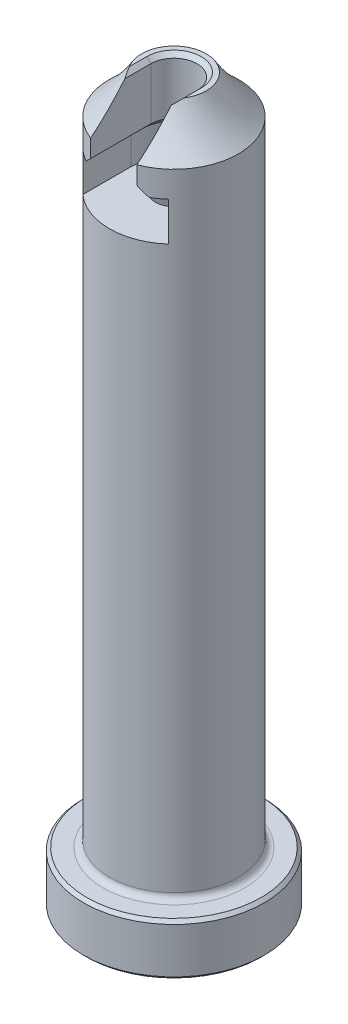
ISO-10303-21;
HEADER;
FILE_DESCRIPTION(('STEP AP214'),'2;1');
FILE_NAME('part.step','',(''),(''),'','','');
FILE_SCHEMA(('AUTOMOTIVE_DESIGN { 1 0 10303 214 1 1 1 1 }'));
ENDSEC;
DATA;
#1=APPLICATION_CONTEXT('core data for automotive mechanical design processes');
#2=APPLICATION_PROTOCOL_DEFINITION('international standard','automotive_design',2000,#1);
#3=PRODUCT_CONTEXT('',#1,'mechanical');
#4=PRODUCT('Part','Part','',(#3));
#5=PRODUCT_RELATED_PRODUCT_CATEGORY('part','',(#4));
#6=PRODUCT_DEFINITION_FORMATION('','',#4);
#7=PRODUCT_DEFINITION_CONTEXT('part definition',#1,'design');
#8=PRODUCT_DEFINITION('design','',#6,#7);
#9=PRODUCT_DEFINITION_SHAPE('','',#8);
#10=(LENGTH_UNIT() NAMED_UNIT(*) SI_UNIT(.MILLI.,.METRE.));
#11=(NAMED_UNIT(*) PLANE_ANGLE_UNIT() SI_UNIT($,.RADIAN.));
#12=(NAMED_UNIT(*) SI_UNIT($,.STERADIAN.) SOLID_ANGLE_UNIT());
#13=UNCERTAINTY_MEASURE_WITH_UNIT(LENGTH_MEASURE(1.E-05),#10,'distance_accuracy_value','');
#14=(GEOMETRIC_REPRESENTATION_CONTEXT(3) GLOBAL_UNCERTAINTY_ASSIGNED_CONTEXT((#13)) GLOBAL_UNIT_ASSIGNED_CONTEXT((#10,
#11,#12)) REPRESENTATION_CONTEXT('',''));
#15=CARTESIAN_POINT('',(0.,0.,0.));
#16=DIRECTION('',(0.,0.,1.));
#17=DIRECTION('',(1.,0.,0.));
#18=AXIS2_PLACEMENT_3D('',#15,#16,#17);
#19=CARTESIAN_POINT('',(0.,260.104415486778,0.));
#20=DIRECTION('',(0.,1.,0.));
#21=DIRECTION('',(0.,0.,1.));
#22=AXIS2_PLACEMENT_3D('',#19,#20,#21);
#23=CYLINDRICAL_SURFACE('',#22,7.93749999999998);
#24=CARTESIAN_POINT('',(0.,7.11200000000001,0.));
#25=DIRECTION('',(0.,1.,0.));
#26=DIRECTION('',(0.,0.,1.));
#27=AXIS2_PLACEMENT_3D('',#24,#25,#26);
#28=CIRCLE('',#27,7.93749999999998);
#29=CARTESIAN_POINT('',(0.,7.11200000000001,7.93749999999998));
#30=VERTEX_POINT('',#29);
#31=EDGE_CURVE('E43',#30,#30,#28,.T.);
#32=ORIENTED_EDGE('',*,*,#31,.T.);
#33=EDGE_LOOP('',(#32));
#34=FACE_BOUND('',#33,.T.);
#35=DIRECTION('',(0.,1.,0.));
#36=VECTOR('',#35,1.);
#37=CARTESIAN_POINT('',(2.8448,-0.001000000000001,7.41019697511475));
#38=LINE('',#37,#36);
#39=CARTESIAN_POINT('',(2.8448,81.9912,7.41019697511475));
#40=VERTEX_POINT('',#39);
#41=CARTESIAN_POINT('',(2.84479999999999,84.1756,7.41019697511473));
#42=VERTEX_POINT('',#41);
#43=EDGE_CURVE('E149',#40,#42,#38,.T.);
#44=ORIENTED_EDGE('',*,*,#43,.F.);
#45=CARTESIAN_POINT('',(0.,84.836,0.));
#46=DIRECTION('',(0.707106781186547,0.707106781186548,0.));
#47=DIRECTION('',(-0.707106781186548,0.707106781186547,0.));
#48=AXIS2_PLACEMENT_3D('',#45,#46,#47);
#49=ELLIPSE('',#48,11.2253201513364,7.93749999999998);
#50=CARTESIAN_POINT('',(3.86080000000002,80.9752,6.9352815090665));
#51=VERTEX_POINT('',#50);
#52=EDGE_CURVE('E171',#40,#51,#49,.T.);
#53=ORIENTED_EDGE('',*,*,#52,.T.);
#54=CARTESIAN_POINT('',(0.,80.9752,0.));
#55=DIRECTION('',(0.,1.,0.));
#56=DIRECTION('',(0.,0.,1.));
#57=AXIS2_PLACEMENT_3D('',#54,#55,#56);
#58=CIRCLE('',#57,7.93749999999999);
#59=CARTESIAN_POINT('',(5.2832,80.9752,5.92382511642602));
#60=VERTEX_POINT('',#59);
#61=EDGE_CURVE('E369',#51,#60,#58,.T.);
#62=ORIENTED_EDGE('',*,*,#61,.T.);
#63=DIRECTION('',(0.,-1.,0.));
#64=VECTOR('',#63,1.);
#65=CARTESIAN_POINT('',(5.2832,97.8996118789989,5.92382511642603));
#66=LINE('',#65,#64);
#67=CARTESIAN_POINT('',(5.2832,76.2,5.92382511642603));
#68=VERTEX_POINT('',#67);
#69=EDGE_CURVE('E393',#60,#68,#66,.T.);
#70=ORIENTED_EDGE('',*,*,#69,.T.);
#71=CARTESIAN_POINT('',(0.,76.2,0.));
#72=DIRECTION('',(0.,1.,0.));
#73=DIRECTION('',(0.,0.,1.));
#74=AXIS2_PLACEMENT_3D('',#71,#72,#73);
#75=CIRCLE('',#74,7.93749999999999);
#76=CARTESIAN_POINT('',(-5.2832,76.2,5.92382511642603));
#77=VERTEX_POINT('',#76);
#78=EDGE_CURVE('E392',#77,#68,#75,.T.);
#79=ORIENTED_EDGE('',*,*,#78,.F.);
#80=DIRECTION('',(0.,-1.,0.));
#81=VECTOR('',#80,1.);
#82=CARTESIAN_POINT('',(-5.2832,97.8996118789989,5.92382511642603));
#83=LINE('',#82,#81);
#84=CARTESIAN_POINT('',(-5.2832,80.9752,5.92382511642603));
#85=VERTEX_POINT('',#84);
#86=EDGE_CURVE('E390',#85,#77,#83,.T.);
#87=ORIENTED_EDGE('',*,*,#86,.F.);
#88=CARTESIAN_POINT('',(-3.86080000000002,80.9752,6.9352815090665));
#89=VERTEX_POINT('',#88);
#90=EDGE_CURVE('E374',#85,#89,#58,.T.);
#91=ORIENTED_EDGE('',*,*,#90,.T.);
#92=CARTESIAN_POINT('',(0.,84.836,0.));
#93=DIRECTION('',(-0.707106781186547,0.707106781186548,0.));
#94=DIRECTION('',(0.707106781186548,0.707106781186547,0.));
#95=AXIS2_PLACEMENT_3D('',#92,#93,#94);
#96=ELLIPSE('',#95,11.2253201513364,7.93749999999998);
#97=CARTESIAN_POINT('',(-2.8448,81.9912,7.41019697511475));
#98=VERTEX_POINT('',#97);
#99=EDGE_CURVE('E160',#89,#98,#96,.T.);
#100=ORIENTED_EDGE('',*,*,#99,.T.);
#101=DIRECTION('',(0.,1.,0.));
#102=VECTOR('',#101,1.);
#103=CARTESIAN_POINT('',(-2.8448,-0.001000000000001,7.41019697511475));
#104=LINE('',#103,#102);
#105=CARTESIAN_POINT('',(-2.8448,84.1756,7.41019697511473));
#106=VERTEX_POINT('',#105);
#107=EDGE_CURVE('E144',#98,#106,#104,.T.);
#108=ORIENTED_EDGE('',*,*,#107,.T.);
#109=CARTESIAN_POINT('',(0.,84.1756,0.));
#110=DIRECTION('',(0.,1.,0.));
#111=DIRECTION('',(0.,0.,1.));
#112=AXIS2_PLACEMENT_3D('',#109,#110,#111);
#113=CIRCLE('',#112,7.93749999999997);
#114=EDGE_CURVE('E138',#42,#106,#113,.T.);
#115=ORIENTED_EDGE('',*,*,#114,.F.);
#116=EDGE_LOOP('',(#44,#53,#62,#70,#79,#87,#91,#100,#108,#115));
#117=FACE_BOUND('',#116,.T.);
#118=ADVANCED_FACE('F35',(#34,#117),#23,.T.);
#119=CARTESIAN_POINT('',(0.,0.,0.));
#120=DIRECTION('',(0.,-1.,0.));
#121=DIRECTION('',(0.,0.,-1.));
#122=AXIS2_PLACEMENT_3D('',#119,#120,#121);
#123=PLANE('',#122);
#124=CARTESIAN_POINT('',(0.,0.,0.));
#125=DIRECTION('',(0.,-1.,0.));
#126=DIRECTION('',(0.,0.,-1.));
#127=AXIS2_PLACEMENT_3D('',#124,#125,#126);
#128=CIRCLE('',#127,3.048);
#129=CARTESIAN_POINT('',(0.,0.,-3.048));
#130=VERTEX_POINT('',#129);
#131=EDGE_CURVE('E206',#130,#130,#128,.F.);
#132=ORIENTED_EDGE('',*,*,#131,.T.);
#133=EDGE_LOOP('',(#132));
#134=FACE_BOUND('',#133,.T.);
#135=CARTESIAN_POINT('',(0.,0.,0.));
#136=DIRECTION('',(0.,-1.,0.));
#137=DIRECTION('',(0.,0.,-1.));
#138=AXIS2_PLACEMENT_3D('',#135,#136,#137);
#139=CIRCLE('',#138,10.7315);
#140=CARTESIAN_POINT('',(0.,0.,-10.7315));
#141=VERTEX_POINT('',#140);
#142=EDGE_CURVE('E197',#141,#141,#139,.T.);
#143=ORIENTED_EDGE('',*,*,#142,.T.);
#144=EDGE_LOOP('',(#143));
#145=FACE_BOUND('',#144,.T.);
#146=ADVANCED_FACE('F271',(#134,#145),#123,.T.);
#147=CARTESIAN_POINT('',(0.,260.104415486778,0.));
#148=DIRECTION('',(0.,1.,0.));
#149=DIRECTION('',(0.,0.,1.));
#150=AXIS2_PLACEMENT_3D('',#147,#148,#149);
#151=CYLINDRICAL_SURFACE('',#150,11.1125);
#152=CARTESIAN_POINT('',(0.,0.38100000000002,0.));
#153=DIRECTION('',(0.,-1.,0.));
#154=DIRECTION('',(0.,0.,-1.));
#155=AXIS2_PLACEMENT_3D('',#152,#153,#154);
#156=CIRCLE('',#155,11.1125);
#157=CARTESIAN_POINT('',(0.,0.38100000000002,-11.1125));
#158=VERTEX_POINT('',#157);
#159=EDGE_CURVE('E194',#158,#158,#156,.F.);
#160=ORIENTED_EDGE('',*,*,#159,.T.);
#161=EDGE_LOOP('',(#160));
#162=FACE_BOUND('',#161,.T.);
#163=CARTESIAN_POINT('',(0.,5.96899999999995,0.));
#164=DIRECTION('',(0.,1.,0.));
#165=DIRECTION('',(0.,0.,1.));
#166=AXIS2_PLACEMENT_3D('',#163,#164,#165);
#167=CIRCLE('',#166,11.1125);
#168=CARTESIAN_POINT('',(0.,5.96899999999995,11.1125));
#169=VERTEX_POINT('',#168);
#170=EDGE_CURVE('E183',#169,#169,#167,.F.);
#171=ORIENTED_EDGE('',*,*,#170,.T.);
#172=EDGE_LOOP('',(#171));
#173=FACE_BOUND('',#172,.T.);
#174=ADVANCED_FACE('F274',(#162,#173),#151,.T.);
#175=CARTESIAN_POINT('',(-11.1125,6.34999999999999,0.));
#176=DIRECTION('',(0.,1.,0.));
#177=DIRECTION('',(0.,0.,1.));
#178=AXIS2_PLACEMENT_3D('',#175,#176,#177);
#179=PLANE('',#178);
#180=CARTESIAN_POINT('',(0.,6.34999999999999,0.));
#181=DIRECTION('',(0.,1.,0.));
#182=DIRECTION('',(0.,0.,1.));
#183=AXIS2_PLACEMENT_3D('',#180,#181,#182);
#184=CIRCLE('',#183,8.69949999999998);
#185=CARTESIAN_POINT('',(0.,6.34999999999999,8.69949999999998));
#186=VERTEX_POINT('',#185);
#187=EDGE_CURVE('E12',#186,#186,#184,.F.);
#188=ORIENTED_EDGE('',*,*,#187,.T.);
#189=EDGE_LOOP('',(#188));
#190=FACE_BOUND('',#189,.T.);
#191=CARTESIAN_POINT('',(0.,6.34999999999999,0.));
#192=DIRECTION('',(0.,1.,0.));
#193=DIRECTION('',(0.,0.,1.));
#194=AXIS2_PLACEMENT_3D('',#191,#192,#193);
#195=CIRCLE('',#194,10.7314999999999);
#196=CARTESIAN_POINT('',(0.,6.34999999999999,10.7314999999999));
#197=VERTEX_POINT('',#196);
#198=EDGE_CURVE('E200',#197,#197,#195,.T.);
#199=ORIENTED_EDGE('',*,*,#198,.T.);
#200=EDGE_LOOP('',(#199));
#201=FACE_BOUND('',#200,.T.);
#202=ADVANCED_FACE('F278',(#190,#201),#179,.T.);
#203=CARTESIAN_POINT('',(0.,98.6404351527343,0.));
#204=DIRECTION('',(0.,1.,0.));
#205=DIRECTION('',(0.,0.,1.));
#206=AXIS2_PLACEMENT_3D('',#203,#204,#205);
#207=TOROIDAL_SURFACE('',#206,20.3339125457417,19.05);
#208=CARTESIAN_POINT('',(0.,88.9,0.));
#209=DIRECTION('',(0.,1.,0.));
#210=DIRECTION('',(0.,0.,1.));
#211=AXIS2_PLACEMENT_3D('',#208,#209,#210);
#212=CIRCLE('',#211,3.96239999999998);
#213=CARTESIAN_POINT('',(3.35279999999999,88.9,2.11171634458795));
#214=VERTEX_POINT('',#213);
#215=CARTESIAN_POINT('',(-3.35279999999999,88.9,2.11171634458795));
#216=VERTEX_POINT('',#215);
#217=EDGE_CURVE('E158',#214,#216,#212,.T.);
#218=ORIENTED_EDGE('',*,*,#217,.F.);
#219=CARTESIAN_POINT('',(3.35279999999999,88.9,2.11171634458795));
#220=CARTESIAN_POINT('',(3.31726358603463,88.8644635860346,2.20781187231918));
#221=CARTESIAN_POINT('',(3.27974791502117,88.8269479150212,2.30241191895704));
#222=CARTESIAN_POINT('',(3.20125496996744,88.7484549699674,2.48838390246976));
#223=CARTESIAN_POINT('',(3.16028645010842,88.7074864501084,2.57976321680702));
#224=CARTESIAN_POINT('',(3.07522099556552,88.6224209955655,2.75949772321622));
#225=CARTESIAN_POINT('',(3.03112519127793,88.5783251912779,2.84785399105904));
#226=CARTESIAN_POINT('',(2.94003217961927,88.4872321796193,3.02186512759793));
#227=CARTESIAN_POINT('',(2.89302807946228,88.4402280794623,3.10751279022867));
#228=CARTESIAN_POINT('',(2.84480000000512,88.3920000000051,3.19173245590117));
#229=B_SPLINE_CURVE_WITH_KNOTS('',3,(#219,#220,#221,#222,#223,#224,#225,#226,#227,#228),
.UNSPECIFIED.,.F.,.F.,(4,2,2,2,4),(0.,0.325244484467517,0.649687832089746,0.974014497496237,
1.29914168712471),.UNSPECIFIED.);
#230=CARTESIAN_POINT('',(2.8448,88.3920000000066,3.19173245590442));
#231=VERTEX_POINT('',#230);
#232=EDGE_CURVE('E140',#214,#231,#229,.T.);
#233=ORIENTED_EDGE('',*,*,#232,.T.);
#234=CARTESIAN_POINT('',(2.8448,83.1560143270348,-8.78831553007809));
#235=CARTESIAN_POINT('',(2.8448,83.355272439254,-8.49600042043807));
#236=CARTESIAN_POINT('',(2.8448,83.5616634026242,-8.20858987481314));
#237=CARTESIAN_POINT('',(2.8448,83.9876336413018,-7.64385696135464));
#238=CARTESIAN_POINT('',(2.8448,84.2072085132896,-7.36653127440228));
#239=CARTESIAN_POINT('',(2.8448,84.6573514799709,-6.82356216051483));
#240=CARTESIAN_POINT('',(2.8448,84.8878518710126,-6.55786248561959));
#241=CARTESIAN_POINT('',(2.8448,85.3598326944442,-6.03638656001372));
#242=CARTESIAN_POINT('',(2.8448,85.6013138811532,-5.78061099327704));
#243=CARTESIAN_POINT('',(2.8448,86.0838740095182,-5.28878249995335));
#244=CARTESIAN_POINT('',(2.8448,86.3245679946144,-5.05235062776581));
#245=CARTESIAN_POINT('',(2.8448,86.8134261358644,-4.5873864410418));
#246=CARTESIAN_POINT('',(2.8448,87.0615899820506,-4.35885379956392));
#247=CARTESIAN_POINT('',(2.8448,87.4381903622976,-4.02071405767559));
#248=CARTESIAN_POINT('',(2.8448,87.5645075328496,-3.9087279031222));
#249=CARTESIAN_POINT('',(2.8448,87.8182668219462,-3.68603677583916));
#250=CARTESIAN_POINT('',(2.8448,87.9457089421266,-3.57533180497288));
#251=CARTESIAN_POINT('',(2.8448,88.2013659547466,-3.35481593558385));
#252=CARTESIAN_POINT('',(2.8448,88.3295808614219,-3.24500505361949));
#253=CARTESIAN_POINT('',(2.8448,88.5863275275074,-3.02575528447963));
#254=CARTESIAN_POINT('',(2.8448,88.7148592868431,-2.91631639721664));
#255=CARTESIAN_POINT('',(2.8448,88.9369157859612,-2.7267130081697));
#256=CARTESIAN_POINT('',(2.8448,89.0305115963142,-2.64663193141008));
#257=CARTESIAN_POINT('',(2.8448,89.21720722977,-2.48590167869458));
#258=CARTESIAN_POINT('',(2.8448,89.3103070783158,-2.40525253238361));
#259=CARTESIAN_POINT('',(2.8448,89.4964459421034,-2.24212615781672));
#260=CARTESIAN_POINT('',(2.8448,89.5894761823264,-2.15963887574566));
#261=CARTESIAN_POINT('',(2.8448,89.773923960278,-1.99291912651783));
#262=CARTESIAN_POINT('',(2.8448,89.8653419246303,-1.90868713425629));
#263=CARTESIAN_POINT('',(2.8448,90.0466270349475,-1.73659069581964));
#264=CARTESIAN_POINT('',(2.8448,90.1364662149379,-1.64869656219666));
#265=CARTESIAN_POINT('',(2.8448,90.3121327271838,-1.46867458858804));
#266=CARTESIAN_POINT('',(2.8448,90.3979540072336,-1.37654075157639));
#267=CARTESIAN_POINT('',(2.8448,90.5620338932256,-1.18717517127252));
#268=CARTESIAN_POINT('',(2.8448,90.6403553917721,-1.08999878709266));
#269=CARTESIAN_POINT('',(2.8448,90.7855567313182,-0.8875813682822));
#270=CARTESIAN_POINT('',(2.8448,90.8524756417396,-0.782369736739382));
#271=CARTESIAN_POINT('',(2.8448,90.9517632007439,-0.590527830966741));
#272=CARTESIAN_POINT('',(2.8448,90.9885900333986,-0.506277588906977));
#273=CARTESIAN_POINT('',(2.8448,91.0465192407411,-0.332623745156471));
#274=CARTESIAN_POINT('',(2.8448,91.0676886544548,-0.243243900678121));
#275=CARTESIAN_POINT('',(2.8448,91.0878649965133,-0.0804347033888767));
#276=CARTESIAN_POINT('',(2.8448,91.0905065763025,-0.00746274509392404));
#277=CARTESIAN_POINT('',(2.8448,91.0828075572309,0.137839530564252));
#278=CARTESIAN_POINT('',(2.8448,91.0724535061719,0.210169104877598));
#279=CARTESIAN_POINT('',(2.8448,91.0358589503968,0.371686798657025));
#280=CARTESIAN_POINT('',(2.8448,91.0060323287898,0.460040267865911));
#281=CARTESIAN_POINT('',(2.8448,90.9329198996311,0.630954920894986));
#282=CARTESIAN_POINT('',(2.8448,90.8895970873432,0.713499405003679));
#283=CARTESIAN_POINT('',(2.8448,90.7764442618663,0.902553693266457));
#284=CARTESIAN_POINT('',(2.8448,90.7027299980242,1.0066807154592));
#285=CARTESIAN_POINT('',(2.8448,90.5456917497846,1.20752491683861));
#286=CARTESIAN_POINT('',(2.8448,90.4623435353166,1.3042223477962));
#287=CARTESIAN_POINT('',(2.8448,90.2892356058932,1.49316081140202));
#288=CARTESIAN_POINT('',(2.8448,90.1994271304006,1.58535662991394));
#289=CARTESIAN_POINT('',(2.8448,90.0621225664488,1.72086847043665));
#290=CARTESIAN_POINT('',(2.8448,90.0159501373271,1.76555013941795));
#291=CARTESIAN_POINT('',(2.8448,89.9228977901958,1.85416864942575));
#292=CARTESIAN_POINT('',(2.8448,89.8760179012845,1.89810552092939));
#293=CARTESIAN_POINT('',(2.8448,89.7198698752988,2.04261791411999));
#294=CARTESIAN_POINT('',(2.8448,89.6094120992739,2.14190448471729));
#295=CARTESIAN_POINT('',(2.8448,89.3868778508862,2.33865082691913));
#296=CARTESIAN_POINT('',(2.8448,89.2748012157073,2.43611041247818));
#297=CARTESIAN_POINT('',(2.8448,89.0498339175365,2.63014438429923));
#298=CARTESIAN_POINT('',(2.8448,88.9369430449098,2.72671852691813));
#299=CARTESIAN_POINT('',(2.8448,88.7109503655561,2.91962004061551));
#300=CARTESIAN_POINT('',(2.8448,88.5978485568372,3.01594740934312));
#301=CARTESIAN_POINT('',(2.8448,88.25870365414,3.30548163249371));
#302=CARTESIAN_POINT('',(2.8448,88.032999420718,3.49908979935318));
#303=CARTESIAN_POINT('',(2.8448,87.5848525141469,3.89000153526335));
#304=CARTESIAN_POINT('',(2.8448,87.3624093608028,4.08730455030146));
#305=CARTESIAN_POINT('',(2.8448,86.9240078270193,4.48559716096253));
#306=CARTESIAN_POINT('',(2.8448,86.7080122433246,4.68654564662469));
#307=CARTESIAN_POINT('',(2.8448,86.2818436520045,5.09455375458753));
#308=CARTESIAN_POINT('',(2.8448,86.0716708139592,5.30161355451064));
#309=CARTESIAN_POINT('',(2.8448,85.6580630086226,5.7224099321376));
#310=CARTESIAN_POINT('',(2.8448,85.454628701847,5.93614716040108));
#311=CARTESIAN_POINT('',(2.8448,85.0553202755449,6.3705680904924));
#312=CARTESIAN_POINT('',(2.8448,84.85944591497,6.59125157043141));
#313=CARTESIAN_POINT('',(2.8448,84.4723523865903,7.04389017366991));
#314=CARTESIAN_POINT('',(2.8448,84.2812894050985,7.27597906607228));
#315=CARTESIAN_POINT('',(2.8448,83.9084048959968,7.7474434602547));
#316=CARTESIAN_POINT('',(2.8448,83.7265827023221,7.98681843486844));
#317=CARTESIAN_POINT('',(2.8448,83.3727747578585,8.47271871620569));
#318=CARTESIAN_POINT('',(2.8448,83.2007883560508,8.71924354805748));
#319=CARTESIAN_POINT('',(2.8448,82.8671485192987,9.21927431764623));
#320=CARTESIAN_POINT('',(2.8448,82.7054981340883,9.47278228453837));
#321=CARTESIAN_POINT('',(2.8448,82.2356301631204,10.2453180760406));
#322=CARTESIAN_POINT('',(2.8448,81.9438607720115,10.7744906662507));
#323=CARTESIAN_POINT('',(2.8448,81.4078504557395,11.8563942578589));
#324=CARTESIAN_POINT('',(2.8448,81.1636056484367,12.4091233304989));
#325=CARTESIAN_POINT('',(2.8448,80.8424781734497,13.2338192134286));
#326=CARTESIAN_POINT('',(2.8448,80.7458334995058,13.498226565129));
#327=CARTESIAN_POINT('',(2.8448,80.5637710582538,14.0308018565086));
#328=CARTESIAN_POINT('',(2.8448,80.4783495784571,14.2989685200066));
#329=CARTESIAN_POINT('',(2.8448,80.3193220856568,14.8373594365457));
#330=CARTESIAN_POINT('',(2.8448,80.2456605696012,15.107567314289));
#331=CARTESIAN_POINT('',(2.8448,80.1098169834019,15.6509514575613));
#332=CARTESIAN_POINT('',(2.8448,80.0476388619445,15.9241287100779));
#333=CARTESIAN_POINT('',(2.8448,79.9913093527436,16.1985125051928));
#334=B_SPLINE_CURVE_WITH_KNOTS('',3,(#234,#235,#236,#237,#238,#239,#240,#241,#242,#243,#244,
#245,#246,#247,#248,#249,#250,#251,#252,#253,#254,#255,#256,#257,#258,#259,#260,#261,#262,#263,
#264,#265,#266,#267,#268,#269,#270,#271,#272,#273,#274,#275,#276,#277,#278,#279,#280,#281,#282,
#283,#284,#285,#286,#287,#288,#289,#290,#291,#292,#293,#294,#295,#296,#297,#298,#299,#300,#301,
#302,#303,#304,#305,#306,#307,#308,#309,#310,#311,#312,#313,#314,#315,#316,#317,#318,#319,#320,
#321,#322,#323,#324,#325,#326,#327,#328,#329,#330,#331,#332,#333),.UNSPECIFIED.,.F.,.F.,(4,2,2,
2,2,2,2,2,2,2,2,2,2,2,2,2,2,2,2,2,2,2,2,2,2,2,2,2,2,2,2,2,2,2,2,2,2,2,2,2,2,2,2,2,2,2,2,2,2,4),
(0.,1.0611483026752,2.12194414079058,3.17685826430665,4.23184496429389,5.2438216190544,
6.25575633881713,6.76218061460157,7.2686056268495,7.77503999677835,8.28147424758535,
8.65101156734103,9.0205297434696,9.3935166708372,9.76640337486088,10.1433756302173,
10.5208985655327,10.8949116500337,11.2676162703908,11.5424056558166,11.8160115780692,
12.0339132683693,12.2520407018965,12.5301610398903,12.8090507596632,13.190749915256,
13.5734308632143,13.9593864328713,14.152139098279,14.3448838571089,14.7904058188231,
15.2359729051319,15.681659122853,16.1273495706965,17.0194311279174,17.9113799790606,
18.79632545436,19.6812966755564,20.5663543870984,21.4513838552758,22.3530105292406,
23.2545721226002,24.1560739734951,25.0578406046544,26.8682901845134,28.6785918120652,
29.5229385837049,30.3670053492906,31.2069624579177,32.0472078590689),.UNSPECIFIED.);
#335=EDGE_CURVE('E133',#231,#42,#334,.T.);
#336=ORIENTED_EDGE('',*,*,#335,.T.);
#337=ORIENTED_EDGE('',*,*,#114,.T.);
#338=CARTESIAN_POINT('',(-2.8448,79.9913093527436,16.1985125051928));
#339=CARTESIAN_POINT('',(-2.8448,80.0481273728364,15.9217692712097));
#340=CARTESIAN_POINT('',(-2.8448,80.1108819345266,15.6462826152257));
#341=CARTESIAN_POINT('',(-2.8448,80.2480950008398,15.0982487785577));
#342=CARTESIAN_POINT('',(-2.8448,80.3225531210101,14.8257015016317));
#343=CARTESIAN_POINT('',(-2.8448,80.5631333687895,14.0134252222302));
#344=CARTESIAN_POINT('',(-2.8448,80.7465340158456,13.478709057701));
#345=CARTESIAN_POINT('',(-2.8448,81.155960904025,12.4303067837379));
#346=CARTESIAN_POINT('',(-2.8448,81.3816774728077,11.9164989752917));
#347=CARTESIAN_POINT('',(-2.8448,81.8742672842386,10.9089681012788));
#348=CARTESIAN_POINT('',(-2.8448,82.141143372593,10.4152464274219));
#349=CARTESIAN_POINT('',(-2.8448,82.7172307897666,9.44382602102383));
#350=CARTESIAN_POINT('',(-2.8448,83.0269832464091,8.96644901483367));
#351=CARTESIAN_POINT('',(-2.8448,83.6824864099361,8.03709850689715));
#352=CARTESIAN_POINT('',(-2.8448,84.0282368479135,7.58512481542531));
#353=CARTESIAN_POINT('',(-2.8448,84.5702154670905,6.92753886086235));
#354=CARTESIAN_POINT('',(-2.8448,84.7545370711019,6.71198052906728));
#355=CARTESIAN_POINT('',(-2.8448,85.1305068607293,6.28735365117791));
#356=CARTESIAN_POINT('',(-2.8448,85.3221547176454,6.07828481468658));
#357=CARTESIAN_POINT('',(-2.8448,85.7120876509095,5.66651318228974));
#358=CARTESIAN_POINT('',(-2.8448,85.9103716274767,5.46380934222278));
#359=CARTESIAN_POINT('',(-2.8448,86.312857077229,5.0643843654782));
#360=CARTESIAN_POINT('',(-2.8448,86.5170584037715,4.86766308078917));
#361=CARTESIAN_POINT('',(-2.8448,86.8974898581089,4.5105711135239));
#362=CARTESIAN_POINT('',(-2.8448,87.0729814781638,4.34941068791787));
#363=CARTESIAN_POINT('',(-2.8448,87.4269141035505,4.0302872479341));
#364=CARTESIAN_POINT('',(-2.8448,87.6053557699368,3.87232496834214));
#365=CARTESIAN_POINT('',(-2.8448,87.9663077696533,3.55708106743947));
#366=CARTESIAN_POINT('',(-2.8448,88.1488412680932,3.39982608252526));
#367=CARTESIAN_POINT('',(-2.8448,88.5146876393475,3.08669206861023));
#368=CARTESIAN_POINT('',(-2.8448,88.6979992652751,2.93081157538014));
#369=CARTESIAN_POINT('',(-2.8448,88.9736277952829,2.69530172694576));
#370=CARTESIAN_POINT('',(-2.8448,89.0662193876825,2.61599477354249));
#371=CARTESIAN_POINT('',(-2.8448,89.2508716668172,2.45676616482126));
#372=CARTESIAN_POINT('',(-2.8448,89.3429323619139,2.37684451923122));
#373=CARTESIAN_POINT('',(-2.8448,89.5265578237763,2.21547608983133));
#374=CARTESIAN_POINT('',(-2.8448,89.6181175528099,2.13402355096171));
#375=CARTESIAN_POINT('',(-2.8448,89.7995940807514,1.96934702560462));
#376=CARTESIAN_POINT('',(-2.8448,89.8895113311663,1.88612353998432));
#377=CARTESIAN_POINT('',(-2.8448,90.064848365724,1.71880967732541));
#378=CARTESIAN_POINT('',(-2.8448,90.1503234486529,1.63477764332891));
#379=CARTESIAN_POINT('',(-2.8448,90.317541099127,1.46281455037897));
#380=CARTESIAN_POINT('',(-2.8448,90.3992788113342,1.37487869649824));
#381=CARTESIAN_POINT('',(-2.8448,90.5558648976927,1.19442321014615));
#382=CARTESIAN_POINT('',(-2.8448,90.6307694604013,1.10195287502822));
#383=CARTESIAN_POINT('',(-2.8448,90.7704894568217,0.90976253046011));
#384=CARTESIAN_POINT('',(-2.8448,90.8353357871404,0.810066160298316));
#385=CARTESIAN_POINT('',(-2.8448,90.9108971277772,0.670304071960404));
#386=CARTESIAN_POINT('',(-2.8448,90.9290990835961,0.634293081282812));
#387=CARTESIAN_POINT('',(-2.8448,90.9631634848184,0.561160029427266));
#388=CARTESIAN_POINT('',(-2.8448,90.9790245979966,0.524037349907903));
#389=CARTESIAN_POINT('',(-2.8448,91.0223975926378,0.411208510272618));
#390=CARTESIAN_POINT('',(-2.8448,91.0458164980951,0.333833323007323));
#391=CARTESIAN_POINT('',(-2.8448,91.0784791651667,0.174991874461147));
#392=CARTESIAN_POINT('',(-2.8448,91.087539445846,0.0934861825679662));
#393=CARTESIAN_POINT('',(-2.8448,91.0891185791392,-0.0697653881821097));
#394=CARTESIAN_POINT('',(-2.8448,91.0816234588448,-0.151511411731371));
#395=CARTESIAN_POINT('',(-2.8448,91.0503818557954,-0.318360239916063));
#396=CARTESIAN_POINT('',(-2.8448,91.0254036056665,-0.403221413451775));
#397=CARTESIAN_POINT('',(-2.8448,90.9622584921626,-0.567818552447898));
#398=CARTESIAN_POINT('',(-2.8448,90.924066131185,-0.647544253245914));
#399=CARTESIAN_POINT('',(-2.8448,90.8284975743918,-0.820223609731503));
#400=CARTESIAN_POINT('',(-2.8448,90.7687190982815,-0.911812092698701));
#401=CARTESIAN_POINT('',(-2.8448,90.6405613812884,-1.0888464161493));
#402=CARTESIAN_POINT('',(-2.8448,90.5721635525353,-1.17427833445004));
#403=CARTESIAN_POINT('',(-2.8448,90.4293797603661,-1.34118018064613));
#404=CARTESIAN_POINT('',(-2.8448,90.3549478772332,-1.42261030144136));
#405=CARTESIAN_POINT('',(-2.8448,90.2406828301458,-1.54213334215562));
#406=CARTESIAN_POINT('',(-2.8448,90.2021780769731,-1.58151839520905));
#407=CARTESIAN_POINT('',(-2.8448,90.1244397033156,-1.65956033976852));
#408=CARTESIAN_POINT('',(-2.8448,90.0852061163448,-1.69821726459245));
#409=CARTESIAN_POINT('',(-2.8448,89.9574937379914,-1.82214006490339));
#410=CARTESIAN_POINT('',(-2.8448,89.867848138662,-1.90620134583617));
#411=CARTESIAN_POINT('',(-2.8448,89.686720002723,-2.07232614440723));
#412=CARTESIAN_POINT('',(-2.8448,89.5952372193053,-2.15438939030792));
#413=CARTESIAN_POINT('',(-2.8448,89.4111098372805,-2.3172715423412));
#414=CARTESIAN_POINT('',(-2.8448,89.3184647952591,-2.39808994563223));
#415=CARTESIAN_POINT('',(-2.8448,89.1325380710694,-2.55899236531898));
#416=CARTESIAN_POINT('',(-2.8448,89.0392563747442,-2.63907636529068));
#417=CARTESIAN_POINT('',(-2.8448,88.7587780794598,-2.87907568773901));
#418=CARTESIAN_POINT('',(-2.8448,88.5711884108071,-3.0385301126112));
#419=CARTESIAN_POINT('',(-2.8448,88.1969696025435,-3.35847919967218));
#420=CARTESIAN_POINT('',(-2.8448,88.0103402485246,-3.51897360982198));
#421=CARTESIAN_POINT('',(-2.8448,87.6407214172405,-3.84115913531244));
#422=CARTESIAN_POINT('',(-2.8448,87.457714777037,-4.00283047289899));
#423=CARTESIAN_POINT('',(-2.8448,87.0947091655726,-4.32954739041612));
#424=CARTESIAN_POINT('',(-2.8448,86.9147103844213,-4.49459318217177));
#425=CARTESIAN_POINT('',(-2.8448,86.5585103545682,-4.82858112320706));
#426=CARTESIAN_POINT('',(-2.8448,86.3823074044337,-4.99752145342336));
#427=CARTESIAN_POINT('',(-2.8448,86.0341938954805,-5.33976684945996));
#428=CARTESIAN_POINT('',(-2.8448,85.8622832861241,-5.51307186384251));
#429=CARTESIAN_POINT('',(-2.8448,85.4625390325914,-5.9272049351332));
#430=CARTESIAN_POINT('',(-2.8448,85.2367233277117,-6.16999003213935));
#431=CARTESIAN_POINT('',(-2.8448,84.795007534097,-6.66441427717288));
#432=CARTESIAN_POINT('',(-2.8448,84.5791071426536,-6.91605315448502));
#433=CARTESIAN_POINT('',(-2.8448,84.154782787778,-7.4323675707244));
#434=CARTESIAN_POINT('',(-2.8448,83.9465339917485,-7.69718737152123));
#435=CARTESIAN_POINT('',(-2.8448,83.5420366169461,-8.23596071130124));
#436=CARTESIAN_POINT('',(-2.8448,83.3457917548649,-8.50991703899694));
#437=CARTESIAN_POINT('',(-2.8448,83.1560143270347,-8.78831553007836));
#438=B_SPLINE_CURVE_WITH_KNOTS('',3,(#338,#339,#340,#341,#342,#343,#344,#345,#346,#347,#348,
#349,#350,#351,#352,#353,#354,#355,#356,#357,#358,#359,#360,#361,#362,#363,#364,#365,#366,#367,
#368,#369,#370,#371,#372,#373,#374,#375,#376,#377,#378,#379,#380,#381,#382,#383,#384,#385,#386,
#387,#388,#389,#390,#391,#392,#393,#394,#395,#396,#397,#398,#399,#400,#401,#402,#403,#404,#405,
#406,#407,#408,#409,#410,#411,#412,#413,#414,#415,#416,#417,#418,#419,#420,#421,#422,#423,#424,
#425,#426,#427,#428,#429,#430,#431,#432,#433,#434,#435,#436,#437),.UNSPECIFIED.,.F.,.F.,(4,2,2,
2,2,2,2,2,2,2,2,2,2,2,2,2,2,2,2,2,2,2,2,2,2,2,2,2,2,2,2,2,2,2,2,2,2,2,2,2,2,2,2,2,2,2,2,2,2,4),
(0.,0.847409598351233,1.69479136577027,3.38847810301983,5.07022260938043,6.7520834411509,
8.45752613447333,10.1629560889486,11.0136754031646,11.8643565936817,12.7148974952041,
13.565417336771,14.2801653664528,14.9950757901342,15.7178563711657,16.4397408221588,
16.8054790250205,17.1712114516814,17.5388380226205,17.9063619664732,18.265882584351,
18.6258577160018,18.9825394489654,19.3381028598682,19.4590773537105,19.5801204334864,
19.8214954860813,20.0659307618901,20.3105724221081,20.5744545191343,20.8388486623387,
21.1661412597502,21.4941521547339,21.8249485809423,21.9901825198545,22.155408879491,
22.5240323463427,22.8927056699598,23.2615242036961,23.6303509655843,24.3689579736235,
25.1073922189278,25.8399322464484,26.5725183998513,27.3047690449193,28.0370110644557,
29.0314571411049,30.0258728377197,31.036218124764,32.0468746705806),.UNSPECIFIED.);
#439=CARTESIAN_POINT('',(-2.8448,88.3919999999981,3.19173245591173));
#440=VERTEX_POINT('',#439);
#441=EDGE_CURVE('E145',#106,#440,#438,.T.);
#442=ORIENTED_EDGE('',*,*,#441,.T.);
#443=CARTESIAN_POINT('',(-2.8448,88.392,3.1917324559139));
#444=CARTESIAN_POINT('',(-2.89302807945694,88.4402280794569,3.10751279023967));
#445=CARTESIAN_POINT('',(-2.94003217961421,88.4872321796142,3.02186512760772));
#446=CARTESIAN_POINT('',(-3.03112519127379,88.5783251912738,2.84785399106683));
#447=CARTESIAN_POINT('',(-3.07522099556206,88.622420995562,2.75949772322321));
#448=CARTESIAN_POINT('',(-3.16028645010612,88.7074864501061,2.5797632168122));
#449=CARTESIAN_POINT('',(-3.20125496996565,88.7484549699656,2.48838390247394));
#450=CARTESIAN_POINT('',(-3.27974791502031,88.8269479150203,2.30241191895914));
#451=CARTESIAN_POINT('',(-3.31726358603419,88.8644635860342,2.20781187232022));
#452=CARTESIAN_POINT('',(-3.35279999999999,88.9,2.11171634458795));
#453=B_SPLINE_CURVE_WITH_KNOTS('',3,(#443,#444,#445,#446,#447,#448,#449,#450,#451,#452),
.UNSPECIFIED.,.F.,.F.,(4,2,2,2,4),(0.,0.325127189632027,0.649453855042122,0.973897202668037,
1.2991416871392),.UNSPECIFIED.);
#454=EDGE_CURVE('E217',#440,#216,#453,.T.);
#455=ORIENTED_EDGE('',*,*,#454,.T.);
#456=EDGE_LOOP('',(#218,#233,#336,#337,#442,#455));
#457=FACE_BOUND('',#456,.T.);
#458=ADVANCED_FACE('F136',(#457),#207,.F.);
#459=CARTESIAN_POINT('',(-3.96239999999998,88.9,0.));
#460=DIRECTION('',(0.,1.,0.));
#461=DIRECTION('',(0.,0.,1.));
#462=AXIS2_PLACEMENT_3D('',#459,#460,#461);
#463=PLANE('',#462);
#464=CARTESIAN_POINT('',(0.,88.9,0.));
#465=DIRECTION('',(0.,1.,0.));
#466=DIRECTION('',(0.,0.,1.));
#467=AXIS2_PLACEMENT_3D('',#464,#465,#466);
#468=CIRCLE('',#467,3.35279999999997);
#469=CARTESIAN_POINT('',(-3.35279999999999,88.9,0.));
#470=VERTEX_POINT('',#469);
#471=CARTESIAN_POINT('',(3.35279999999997,88.9,0.));
#472=VERTEX_POINT('',#471);
#473=EDGE_CURVE('E213',#470,#472,#468,.F.);
#474=ORIENTED_EDGE('',*,*,#473,.T.);
#475=DIRECTION('',(0.,0.,1.));
#476=VECTOR('',#475,1.);
#477=CARTESIAN_POINT('',(3.35279999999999,88.9,2.75821078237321));
#478=LINE('',#477,#476);
#479=EDGE_CURVE('E215',#472,#214,#478,.T.);
#480=ORIENTED_EDGE('',*,*,#479,.T.);
#481=ORIENTED_EDGE('',*,*,#217,.T.);
#482=DIRECTION('',(0.,0.,-1.));
#483=VECTOR('',#482,1.);
#484=CARTESIAN_POINT('',(-3.35279999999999,88.9,0.));
#485=LINE('',#484,#483);
#486=EDGE_CURVE('E211',#216,#470,#485,.T.);
#487=ORIENTED_EDGE('',*,*,#486,.T.);
#488=EDGE_LOOP('',(#474,#480,#481,#487));
#489=FACE_BOUND('',#488,.T.);
#490=ADVANCED_FACE('F351',(#489),#463,.T.);
#491=CARTESIAN_POINT('',(0.,88.9,0.));
#492=DIRECTION('',(0.,-1.,0.));
#493=DIRECTION('',(0.,0.,-1.));
#494=AXIS2_PLACEMENT_3D('',#491,#492,#493);
#495=CYLINDRICAL_SURFACE('',#494,2.286);
#496=CARTESIAN_POINT('',(0.,0.761999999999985,0.));
#497=DIRECTION('',(0.,-1.,0.));
#498=DIRECTION('',(0.,0.,-1.));
#499=AXIS2_PLACEMENT_3D('',#496,#497,#498);
#500=CIRCLE('',#499,2.286);
#501=CARTESIAN_POINT('',(0.,0.761999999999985,-2.286));
#502=VERTEX_POINT('',#501);
#503=EDGE_CURVE('E203',#502,#502,#500,.T.);
#504=ORIENTED_EDGE('',*,*,#503,.T.);
#505=EDGE_LOOP('',(#504));
#506=FACE_BOUND('',#505,.T.);
#507=CARTESIAN_POINT('',(0.,76.2,0.));
#508=DIRECTION('',(0.,-1.,0.));
#509=DIRECTION('',(0.,0.,-1.));
#510=AXIS2_PLACEMENT_3D('',#507,#508,#509);
#511=CIRCLE('',#510,2.286);
#512=CARTESIAN_POINT('',(0.,76.2,-2.286));
#513=VERTEX_POINT('',#512);
#514=EDGE_CURVE('E163',#513,#513,#511,.F.);
#515=ORIENTED_EDGE('',*,*,#514,.T.);
#516=EDGE_LOOP('',(#515));
#517=FACE_BOUND('',#516,.T.);
#518=ADVANCED_FACE('F348',(#506,#517),#495,.F.);
#519=CARTESIAN_POINT('',(0.,76.2,0.));
#520=DIRECTION('',(0.,-1.,0.));
#521=DIRECTION('',(0.,0.,-1.));
#522=AXIS2_PLACEMENT_3D('',#519,#520,#521);
#523=PLANE('',#522);
#524=CARTESIAN_POINT('',(0.,76.2,0.));
#525=DIRECTION('',(0.,1.,0.));
#526=DIRECTION('',(0.,0.,1.));
#527=AXIS2_PLACEMENT_3D('',#524,#525,#526);
#528=CIRCLE('',#527,5.28319999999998);
#529=CARTESIAN_POINT('',(5.2832,76.2,0.));
#530=VERTEX_POINT('',#529);
#531=CARTESIAN_POINT('',(-5.2832,76.2,0.));
#532=VERTEX_POINT('',#531);
#533=EDGE_CURVE('E168',#530,#532,#528,.T.);
#534=ORIENTED_EDGE('',*,*,#533,.T.);
#535=DIRECTION('',(0.,0.,1.));
#536=VECTOR('',#535,1.);
#537=CARTESIAN_POINT('',(-5.2832,76.2,0.));
#538=LINE('',#537,#536);
#539=EDGE_CURVE('E382',#532,#77,#538,.T.);
#540=ORIENTED_EDGE('',*,*,#539,.T.);
#541=ORIENTED_EDGE('',*,*,#78,.T.);
#542=DIRECTION('',(0.,0.,-1.));
#543=VECTOR('',#542,1.);
#544=CARTESIAN_POINT('',(5.2832,76.2,0.));
#545=LINE('',#544,#543);
#546=EDGE_CURVE('E386',#68,#530,#545,.T.);
#547=ORIENTED_EDGE('',*,*,#546,.T.);
#548=EDGE_LOOP('',(#534,#540,#541,#547));
#549=FACE_BOUND('',#548,.T.);
#550=ORIENTED_EDGE('',*,*,#514,.F.);
#551=EDGE_LOOP('',(#550));
#552=FACE_BOUND('',#551,.T.);
#553=ADVANCED_FACE('F344',(#549,#552),#523,.F.);
#554=CARTESIAN_POINT('',(0.,234.452866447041,0.));
#555=DIRECTION('',(0.,1.,0.));
#556=DIRECTION('',(0.,0.,1.));
#557=AXIS2_PLACEMENT_3D('',#554,#555,#556);
#558=CYLINDRICAL_SURFACE('',#557,5.28319999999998);
#559=CARTESIAN_POINT('',(0.,80.9752,0.));
#560=DIRECTION('',(0.,1.,0.));
#561=DIRECTION('',(0.,0.,1.));
#562=AXIS2_PLACEMENT_3D('',#559,#560,#561);
#563=CIRCLE('',#562,5.28319999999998);
#564=CARTESIAN_POINT('',(5.2832,80.9752,0.));
#565=VERTEX_POINT('',#564);
#566=CARTESIAN_POINT('',(-5.2832,80.9752,0.));
#567=VERTEX_POINT('',#566);
#568=EDGE_CURVE('E378',#565,#567,#563,.T.);
#569=ORIENTED_EDGE('',*,*,#568,.T.);
#570=DIRECTION('',(0.,-1.,0.));
#571=VECTOR('',#570,1.);
#572=CARTESIAN_POINT('',(-5.2832,97.8996118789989,0.));
#573=LINE('',#572,#571);
#574=EDGE_CURVE('E387',#567,#532,#573,.T.);
#575=ORIENTED_EDGE('',*,*,#574,.T.);
#576=ORIENTED_EDGE('',*,*,#533,.F.);
#577=DIRECTION('',(0.,-1.,0.));
#578=VECTOR('',#577,1.);
#579=CARTESIAN_POINT('',(5.2832,97.8996118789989,0.));
#580=LINE('',#579,#578);
#581=EDGE_CURVE('E155',#565,#530,#580,.T.);
#582=ORIENTED_EDGE('',*,*,#581,.F.);
#583=EDGE_LOOP('',(#569,#575,#576,#582));
#584=FACE_BOUND('',#583,.T.);
#585=ADVANCED_FACE('F340',(#584),#558,.F.);
#586=CARTESIAN_POINT('',(-5.28319999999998,80.9752,0.));
#587=DIRECTION('',(0.,1.,0.));
#588=DIRECTION('',(0.,0.,1.));
#589=AXIS2_PLACEMENT_3D('',#586,#587,#588);
#590=PLANE('',#589);
#591=ORIENTED_EDGE('',*,*,#61,.F.);
#592=DIRECTION('',(0.,0.,-1.));
#593=VECTOR('',#592,1.);
#594=CARTESIAN_POINT('',(3.86080000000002,80.9752,0.));
#595=LINE('',#594,#593);
#596=CARTESIAN_POINT('',(3.8608,80.9752,0.));
#597=VERTEX_POINT('',#596);
#598=EDGE_CURVE('E177',#51,#597,#595,.T.);
#599=ORIENTED_EDGE('',*,*,#598,.T.);
#600=CARTESIAN_POINT('',(0.,80.9752,0.));
#601=DIRECTION('',(0.,1.,0.));
#602=DIRECTION('',(0.,0.,1.));
#603=AXIS2_PLACEMENT_3D('',#600,#601,#602);
#604=CIRCLE('',#603,3.8608);
#605=CARTESIAN_POINT('',(-3.8608,80.9752,0.));
#606=VERTEX_POINT('',#605);
#607=EDGE_CURVE('E173',#597,#606,#604,.T.);
#608=ORIENTED_EDGE('',*,*,#607,.T.);
#609=DIRECTION('',(0.,0.,1.));
#610=VECTOR('',#609,1.);
#611=CARTESIAN_POINT('',(-3.86080000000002,80.9752,0.));
#612=LINE('',#611,#610);
#613=EDGE_CURVE('E175',#606,#89,#612,.T.);
#614=ORIENTED_EDGE('',*,*,#613,.T.);
#615=ORIENTED_EDGE('',*,*,#90,.F.);
#616=DIRECTION('',(0.,0.,1.));
#617=VECTOR('',#616,1.);
#618=CARTESIAN_POINT('',(-5.2832,80.9752,0.));
#619=LINE('',#618,#617);
#620=EDGE_CURVE('E375',#567,#85,#619,.T.);
#621=ORIENTED_EDGE('',*,*,#620,.F.);
#622=ORIENTED_EDGE('',*,*,#568,.F.);
#623=DIRECTION('',(0.,0.,-1.));
#624=VECTOR('',#623,1.);
#625=CARTESIAN_POINT('',(5.2832,80.9752,0.));
#626=LINE('',#625,#624);
#627=EDGE_CURVE('E372',#60,#565,#626,.T.);
#628=ORIENTED_EDGE('',*,*,#627,.F.);
#629=EDGE_LOOP('',(#591,#599,#608,#614,#615,#621,#622,#628));
#630=FACE_BOUND('',#629,.T.);
#631=ADVANCED_FACE('F337',(#630),#590,.F.);
#632=CARTESIAN_POINT('',(0.,234.452866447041,0.));
#633=DIRECTION('',(0.,1.,0.));
#634=DIRECTION('',(0.,0.,1.));
#635=AXIS2_PLACEMENT_3D('',#632,#633,#634);
#636=CYLINDRICAL_SURFACE('',#635,2.84479999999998);
#637=DIRECTION('',(0.,1.,0.));
#638=VECTOR('',#637,1.);
#639=CARTESIAN_POINT('',(2.84479999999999,234.452866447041,0.));
#640=LINE('',#639,#638);
#641=CARTESIAN_POINT('',(2.84479999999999,81.9912,0.));
#642=VERTEX_POINT('',#641);
#643=CARTESIAN_POINT('',(2.84479999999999,88.392,0.));
#644=VERTEX_POINT('',#643);
#645=EDGE_CURVE('E298',#642,#644,#640,.T.);
#646=ORIENTED_EDGE('',*,*,#645,.T.);
#647=CARTESIAN_POINT('',(0.,88.392,0.));
#648=DIRECTION('',(0.,1.,0.));
#649=DIRECTION('',(0.,0.,1.));
#650=AXIS2_PLACEMENT_3D('',#647,#648,#649);
#651=CIRCLE('',#650,2.84479999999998);
#652=CARTESIAN_POINT('',(-2.84479999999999,88.392,0.));
#653=VERTEX_POINT('',#652);
#654=EDGE_CURVE('E50',#644,#653,#651,.T.);
#655=ORIENTED_EDGE('',*,*,#654,.T.);
#656=DIRECTION('',(0.,1.,0.));
#657=VECTOR('',#656,1.);
#658=CARTESIAN_POINT('',(-2.84479999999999,234.452866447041,0.));
#659=LINE('',#658,#657);
#660=CARTESIAN_POINT('',(-2.84479999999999,81.9912,0.));
#661=VERTEX_POINT('',#660);
#662=EDGE_CURVE('E191',#661,#653,#659,.T.);
#663=ORIENTED_EDGE('',*,*,#662,.F.);
#664=CARTESIAN_POINT('',(0.,81.9912,0.));
#665=DIRECTION('',(0.,1.,0.));
#666=DIRECTION('',(0.,0.,1.));
#667=AXIS2_PLACEMENT_3D('',#664,#665,#666);
#668=CIRCLE('',#667,2.84479999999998);
#669=EDGE_CURVE('E181',#661,#642,#668,.F.);
#670=ORIENTED_EDGE('',*,*,#669,.T.);
#671=EDGE_LOOP('',(#646,#655,#663,#670));
#672=FACE_BOUND('',#671,.T.);
#673=ADVANCED_FACE('F300',(#672),#636,.F.);
#674=CARTESIAN_POINT('',(-5.2832,97.8996118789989,0.));
#675=DIRECTION('',(1.,0.,0.));
#676=DIRECTION('',(0.,0.,-1.));
#677=AXIS2_PLACEMENT_3D('',#674,#675,#676);
#678=PLANE('',#677);
#679=ORIENTED_EDGE('',*,*,#620,.T.);
#680=ORIENTED_EDGE('',*,*,#86,.T.);
#681=ORIENTED_EDGE('',*,*,#539,.F.);
#682=ORIENTED_EDGE('',*,*,#574,.F.);
#683=EDGE_LOOP('',(#679,#680,#681,#682));
#684=FACE_BOUND('',#683,.T.);
#685=ADVANCED_FACE('F327',(#684),#678,.T.);
#686=CARTESIAN_POINT('',(5.2832,97.8996118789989,0.));
#687=DIRECTION('',(-1.,0.,0.));
#688=DIRECTION('',(0.,0.,1.));
#689=AXIS2_PLACEMENT_3D('',#686,#687,#688);
#690=PLANE('',#689);
#691=ORIENTED_EDGE('',*,*,#627,.T.);
#692=ORIENTED_EDGE('',*,*,#581,.T.);
#693=ORIENTED_EDGE('',*,*,#546,.F.);
#694=ORIENTED_EDGE('',*,*,#69,.F.);
#695=EDGE_LOOP('',(#691,#692,#693,#694));
#696=FACE_BOUND('',#695,.T.);
#697=ADVANCED_FACE('F322',(#696),#690,.T.);
#698=CARTESIAN_POINT('',(2.8448,-0.001000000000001,0.));
#699=DIRECTION('',(1.,0.,0.));
#700=DIRECTION('',(0.,0.,-1.));
#701=AXIS2_PLACEMENT_3D('',#698,#699,#700);
#702=PLANE('',#701);
#703=ORIENTED_EDGE('',*,*,#335,.F.);
#704=DIRECTION('',(0.,0.,-1.));
#705=VECTOR('',#704,1.);
#706=CARTESIAN_POINT('',(2.8448,88.392,0.));
#707=LINE('',#706,#705);
#708=EDGE_CURVE('E209',#231,#644,#707,.T.);
#709=ORIENTED_EDGE('',*,*,#708,.T.);
#710=ORIENTED_EDGE('',*,*,#645,.F.);
#711=DIRECTION('',(0.,0.,1.));
#712=VECTOR('',#711,1.);
#713=CARTESIAN_POINT('',(2.8448,81.9912,0.));
#714=LINE('',#713,#712);
#715=EDGE_CURVE('E153',#642,#40,#714,.T.);
#716=ORIENTED_EDGE('',*,*,#715,.T.);
#717=ORIENTED_EDGE('',*,*,#43,.T.);
#718=EDGE_LOOP('',(#703,#709,#710,#716,#717));
#719=FACE_BOUND('',#718,.T.);
#720=ADVANCED_FACE('F150',(#719),#702,.F.);
#721=CARTESIAN_POINT('',(-2.8448,-0.001000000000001,0.));
#722=DIRECTION('',(-1.,0.,0.));
#723=DIRECTION('',(0.,0.,1.));
#724=AXIS2_PLACEMENT_3D('',#721,#722,#723);
#725=PLANE('',#724);
#726=ORIENTED_EDGE('',*,*,#662,.T.);
#727=DIRECTION('',(0.,0.,1.));
#728=VECTOR('',#727,1.);
#729=CARTESIAN_POINT('',(-2.8448,88.392,2.75821078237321));
#730=LINE('',#729,#728);
#731=EDGE_CURVE('E57',#653,#440,#730,.T.);
#732=ORIENTED_EDGE('',*,*,#731,.T.);
#733=ORIENTED_EDGE('',*,*,#441,.F.);
#734=ORIENTED_EDGE('',*,*,#107,.F.);
#735=DIRECTION('',(0.,0.,-1.));
#736=VECTOR('',#735,1.);
#737=CARTESIAN_POINT('',(-2.8448,81.9912,0.));
#738=LINE('',#737,#736);
#739=EDGE_CURVE('E179',#98,#661,#738,.T.);
#740=ORIENTED_EDGE('',*,*,#739,.T.);
#741=EDGE_LOOP('',(#726,#732,#733,#734,#740));
#742=FACE_BOUND('',#741,.T.);
#743=ADVANCED_FACE('F263',(#742),#725,.F.);
#744=CARTESIAN_POINT('',(-2.8448,81.9912,0.));
#745=DIRECTION('',(-0.707106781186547,0.707106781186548,0.));
#746=DIRECTION('',(0.,0.,-1.));
#747=AXIS2_PLACEMENT_3D('',#744,#745,#746);
#748=PLANE('',#747);
#749=ORIENTED_EDGE('',*,*,#99,.F.);
#750=ORIENTED_EDGE('',*,*,#613,.F.);
#751=DIRECTION('',(-0.707106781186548,-0.707106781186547,0.));
#752=VECTOR('',#751,1.);
#753=CARTESIAN_POINT('',(-2.8448,81.9912,0.));
#754=LINE('',#753,#752);
#755=EDGE_CURVE('E187',#661,#606,#754,.T.);
#756=ORIENTED_EDGE('',*,*,#755,.F.);
#757=ORIENTED_EDGE('',*,*,#739,.F.);
#758=EDGE_LOOP('',(#749,#750,#756,#757));
#759=FACE_BOUND('',#758,.T.);
#760=ADVANCED_FACE('F259',(#759),#748,.F.);
#761=CARTESIAN_POINT('',(0.,80.9752,0.));
#762=DIRECTION('',(0.,-1.,0.));
#763=DIRECTION('',(0.,0.,-1.));
#764=AXIS2_PLACEMENT_3D('',#761,#762,#763);
#765=CONICAL_SURFACE('',#764,3.8608,0.78539816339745);
#766=ORIENTED_EDGE('',*,*,#755,.T.);
#767=ORIENTED_EDGE('',*,*,#607,.F.);
#768=DIRECTION('',(0.707106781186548,-0.707106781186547,0.));
#769=VECTOR('',#768,1.);
#770=CARTESIAN_POINT('',(2.84479999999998,81.9912,0.));
#771=LINE('',#770,#769);
#772=EDGE_CURVE('E184',#642,#597,#771,.T.);
#773=ORIENTED_EDGE('',*,*,#772,.F.);
#774=ORIENTED_EDGE('',*,*,#669,.F.);
#775=EDGE_LOOP('',(#766,#767,#773,#774));
#776=FACE_BOUND('',#775,.T.);
#777=ADVANCED_FACE('F262',(#776),#765,.F.);
#778=CARTESIAN_POINT('',(2.8448,81.9912,0.));
#779=DIRECTION('',(0.707106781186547,0.707106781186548,0.));
#780=DIRECTION('',(0.,0.,1.));
#781=AXIS2_PLACEMENT_3D('',#778,#779,#780);
#782=PLANE('',#781);
#783=ORIENTED_EDGE('',*,*,#772,.T.);
#784=ORIENTED_EDGE('',*,*,#598,.F.);
#785=ORIENTED_EDGE('',*,*,#52,.F.);
#786=ORIENTED_EDGE('',*,*,#715,.F.);
#787=EDGE_LOOP('',(#783,#784,#785,#786));
#788=FACE_BOUND('',#787,.T.);
#789=ADVANCED_FACE('F257',(#788),#782,.F.);
#790=CARTESIAN_POINT('',(0.,0.38100000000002,0.));
#791=DIRECTION('',(0.,1.,0.));
#792=DIRECTION('',(0.,0.,1.));
#793=AXIS2_PLACEMENT_3D('',#790,#791,#792);
#794=CONICAL_SURFACE('',#793,11.1125,0.785398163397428);
#795=ORIENTED_EDGE('',*,*,#142,.F.);
#796=EDGE_LOOP('',(#795));
#797=FACE_BOUND('',#796,.T.);
#798=ORIENTED_EDGE('',*,*,#159,.F.);
#799=EDGE_LOOP('',(#798));
#800=FACE_BOUND('',#799,.T.);
#801=ADVANCED_FACE('F253',(#797,#800),#794,.T.);
#802=CARTESIAN_POINT('',(0.,6.34999999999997,0.));
#803=DIRECTION('',(0.,-1.,0.));
#804=DIRECTION('',(0.,0.,-1.));
#805=AXIS2_PLACEMENT_3D('',#802,#803,#804);
#806=CONICAL_SURFACE('',#805,10.7314999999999,0.785398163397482);
#807=ORIENTED_EDGE('',*,*,#170,.F.);
#808=EDGE_LOOP('',(#807));
#809=FACE_BOUND('',#808,.T.);
#810=ORIENTED_EDGE('',*,*,#198,.F.);
#811=EDGE_LOOP('',(#810));
#812=FACE_BOUND('',#811,.T.);
#813=ADVANCED_FACE('F249',(#809,#812),#806,.T.);
#814=CARTESIAN_POINT('',(0.,0.761999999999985,0.));
#815=DIRECTION('',(0.,-1.,0.));
#816=DIRECTION('',(0.,0.,-1.));
#817=AXIS2_PLACEMENT_3D('',#814,#815,#816);
#818=CONICAL_SURFACE('',#817,2.286,0.785398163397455);
#819=ORIENTED_EDGE('',*,*,#131,.F.);
#820=EDGE_LOOP('',(#819));
#821=FACE_BOUND('',#820,.T.);
#822=ORIENTED_EDGE('',*,*,#503,.F.);
#823=EDGE_LOOP('',(#822));
#824=FACE_BOUND('',#823,.T.);
#825=ADVANCED_FACE('F238',(#821,#824),#818,.F.);
#826=CARTESIAN_POINT('',(-2.8448,88.392,0.));
#827=DIRECTION('',(0.707106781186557,0.707106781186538,0.));
#828=DIRECTION('',(0.,0.,-1.));
#829=AXIS2_PLACEMENT_3D('',#826,#827,#828);
#830=PLANE('',#829);
#831=ORIENTED_EDGE('',*,*,#454,.F.);
#832=ORIENTED_EDGE('',*,*,#731,.F.);
#833=DIRECTION('',(0.707106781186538,-0.707106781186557,0.));
#834=VECTOR('',#833,1.);
#835=CARTESIAN_POINT('',(-3.35279999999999,88.9,0.));
#836=LINE('',#835,#834);
#837=EDGE_CURVE('E188',#470,#653,#836,.T.);
#838=ORIENTED_EDGE('',*,*,#837,.F.);
#839=ORIENTED_EDGE('',*,*,#486,.F.);
#840=EDGE_LOOP('',(#831,#832,#838,#839));
#841=FACE_BOUND('',#840,.T.);
#842=ADVANCED_FACE('F233',(#841),#830,.T.);
#843=CARTESIAN_POINT('',(0.,88.392,0.));
#844=DIRECTION('',(0.,1.,0.));
#845=DIRECTION('',(0.,0.,1.));
#846=AXIS2_PLACEMENT_3D('',#843,#844,#845);
#847=CONICAL_SURFACE('',#846,2.84479999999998,0.785398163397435);
#848=ORIENTED_EDGE('',*,*,#837,.T.);
#849=ORIENTED_EDGE('',*,*,#654,.F.);
#850=DIRECTION('',(-0.707106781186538,-0.707106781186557,0.));
#851=VECTOR('',#850,1.);
#852=CARTESIAN_POINT('',(3.35279999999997,88.9,0.));
#853=LINE('',#852,#851);
#854=EDGE_CURVE('E293',#472,#644,#853,.T.);
#855=ORIENTED_EDGE('',*,*,#854,.F.);
#856=ORIENTED_EDGE('',*,*,#473,.F.);
#857=EDGE_LOOP('',(#848,#849,#855,#856));
#858=FACE_BOUND('',#857,.T.);
#859=ADVANCED_FACE('F237',(#858),#847,.F.);
#860=CARTESIAN_POINT('',(2.8448,88.392,0.));
#861=DIRECTION('',(-0.707106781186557,0.707106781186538,0.));
#862=DIRECTION('',(0.,0.,1.));
#863=AXIS2_PLACEMENT_3D('',#860,#861,#862);
#864=PLANE('',#863);
#865=ORIENTED_EDGE('',*,*,#232,.F.);
#866=ORIENTED_EDGE('',*,*,#479,.F.);
#867=ORIENTED_EDGE('',*,*,#854,.T.);
#868=ORIENTED_EDGE('',*,*,#708,.F.);
#869=EDGE_LOOP('',(#865,#866,#867,#868));
#870=FACE_BOUND('',#869,.T.);
#871=ADVANCED_FACE('F241',(#870),#864,.T.);
#872=CARTESIAN_POINT('',(0.,7.11200000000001,0.));
#873=DIRECTION('',(0.,1.,0.));
#874=DIRECTION('',(0.,0.,1.));
#875=AXIS2_PLACEMENT_3D('',#872,#873,#874);
#876=TOROIDAL_SURFACE('',#875,8.69949999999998,0.762);
#877=ORIENTED_EDGE('',*,*,#187,.F.);
#878=EDGE_LOOP('',(#877));
#879=FACE_BOUND('',#878,.T.);
#880=ORIENTED_EDGE('',*,*,#31,.F.);
#881=EDGE_LOOP('',(#880));
#882=FACE_BOUND('',#881,.T.);
#883=ADVANCED_FACE('F37',(#879,#882),#876,.F.);
#884=CLOSED_SHELL('',(#118,#146,#174,#202,#458,#490,#518,#553,#585,#631,#673,#685,#697,#720,
#743,#760,#777,#789,#801,#813,#825,#842,#859,#871,#883));
#885=MANIFOLD_SOLID_BREP('B2',#884);
#886=ADVANCED_BREP_SHAPE_REPRESENTATION('',(#18,#885),#14);
#887=SHAPE_DEFINITION_REPRESENTATION(#9,#886);
ENDSEC;
END-ISO-10303-21;
